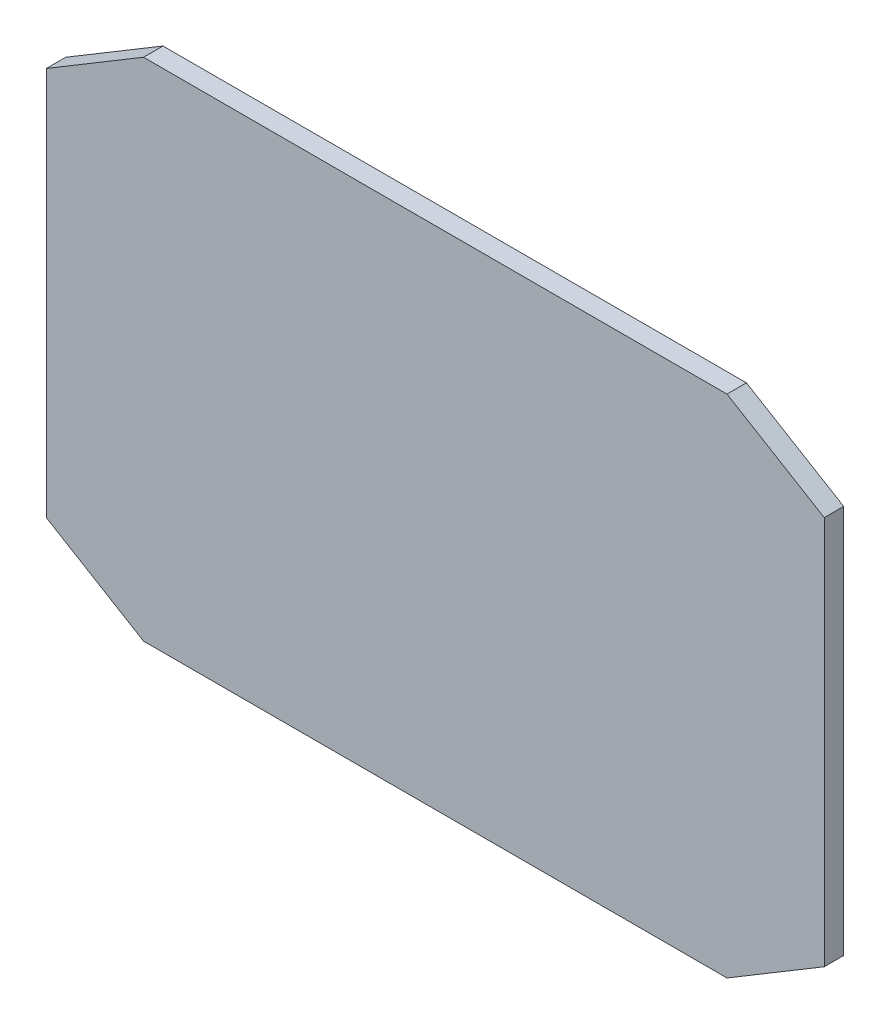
ISO-10303-21;
HEADER;
FILE_DESCRIPTION(('STEP AP214'),'2;1');
FILE_NAME('part.step','',(''),(''),'','','');
FILE_SCHEMA(('AUTOMOTIVE_DESIGN { 1 0 10303 214 1 1 1 1 }'));
ENDSEC;
DATA;
#1=APPLICATION_CONTEXT('core data for automotive mechanical design processes');
#2=APPLICATION_PROTOCOL_DEFINITION('international standard','automotive_design',2000,#1);
#3=PRODUCT_CONTEXT('',#1,'mechanical');
#4=PRODUCT('Part','Part','',(#3));
#5=PRODUCT_RELATED_PRODUCT_CATEGORY('part','',(#4));
#6=PRODUCT_DEFINITION_FORMATION('','',#4);
#7=PRODUCT_DEFINITION_CONTEXT('part definition',#1,'design');
#8=PRODUCT_DEFINITION('design','',#6,#7);
#9=PRODUCT_DEFINITION_SHAPE('','',#8);
#10=(LENGTH_UNIT() NAMED_UNIT(*) SI_UNIT(.MILLI.,.METRE.));
#11=(NAMED_UNIT(*) PLANE_ANGLE_UNIT() SI_UNIT($,.RADIAN.));
#12=(NAMED_UNIT(*) SI_UNIT($,.STERADIAN.) SOLID_ANGLE_UNIT());
#13=UNCERTAINTY_MEASURE_WITH_UNIT(LENGTH_MEASURE(1.E-05),#10,'distance_accuracy_value','');
#14=(GEOMETRIC_REPRESENTATION_CONTEXT(3) GLOBAL_UNCERTAINTY_ASSIGNED_CONTEXT((#13)) GLOBAL_UNIT_ASSIGNED_CONTEXT((#10,
#11,#12)) REPRESENTATION_CONTEXT('',''));
#15=CARTESIAN_POINT('',(0.,0.,0.));
#16=DIRECTION('',(0.,0.,1.));
#17=DIRECTION('',(1.,0.,0.));
#18=AXIS2_PLACEMENT_3D('',#15,#16,#17);
#19=CARTESIAN_POINT('',(0.,-6.66133814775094E-13,10.));
#20=DIRECTION('',(1.,0.,0.));
#21=DIRECTION('',(0.,0.,-1.));
#22=AXIS2_PLACEMENT_3D('',#19,#20,#21);
#23=PLANE('',#22);
#24=DIRECTION('',(0.,-1.,0.));
#25=VECTOR('',#24,1.);
#26=CARTESIAN_POINT('',(0.,0.,0.));
#27=LINE('',#26,#25);
#28=CARTESIAN_POINT('',(0.,230.,-9.99200722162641E-13));
#29=VERTEX_POINT('',#28);
#30=CARTESIAN_POINT('',(0.,30.0000000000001,-6.66133814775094E-13));
#31=VERTEX_POINT('',#30);
#32=EDGE_CURVE('E112',#29,#31,#27,.T.);
#33=ORIENTED_EDGE('',*,*,#32,.T.);
#34=DIRECTION('',(0.,0.,1.));
#35=VECTOR('',#34,1.);
#36=CARTESIAN_POINT('',(0.,30.,9.99999999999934));
#37=LINE('',#36,#35);
#38=CARTESIAN_POINT('',(0.,30.,9.99999999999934));
#39=VERTEX_POINT('',#38);
#40=EDGE_CURVE('E154',#31,#39,#37,.T.);
#41=ORIENTED_EDGE('',*,*,#40,.T.);
#42=DIRECTION('',(0.,-1.,0.));
#43=VECTOR('',#42,1.);
#44=CARTESIAN_POINT('',(0.,-6.66133814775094E-13,10.));
#45=LINE('',#44,#43);
#46=CARTESIAN_POINT('',(0.,230.,9.99999999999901));
#47=VERTEX_POINT('',#46);
#48=EDGE_CURVE('E115',#47,#39,#45,.T.);
#49=ORIENTED_EDGE('',*,*,#48,.F.);
#50=DIRECTION('',(0.,0.,-1.));
#51=VECTOR('',#50,1.);
#52=CARTESIAN_POINT('',(0.,230.,9.99999999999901));
#53=LINE('',#52,#51);
#54=EDGE_CURVE('E101',#47,#29,#53,.T.);
#55=ORIENTED_EDGE('',*,*,#54,.T.);
#56=EDGE_LOOP('',(#33,#41,#49,#55));
#57=FACE_BOUND('',#56,.T.);
#58=ADVANCED_FACE('F32',(#57),#23,.F.);
#59=CARTESIAN_POINT('',(0.,-6.66133814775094E-13,10.));
#60=DIRECTION('',(0.,1.,0.));
#61=DIRECTION('',(0.,0.,1.));
#62=AXIS2_PLACEMENT_3D('',#59,#60,#61);
#63=PLANE('',#62);
#64=DIRECTION('',(1.,0.,0.));
#65=VECTOR('',#64,1.);
#66=CARTESIAN_POINT('',(0.,-6.66133814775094E-13,10.));
#67=LINE('',#66,#65);
#68=CARTESIAN_POINT('',(50.0000000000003,-6.66133814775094E-13,10.));
#69=VERTEX_POINT('',#68);
#70=CARTESIAN_POINT('',(350.,0.,10.));
#71=VERTEX_POINT('',#70);
#72=EDGE_CURVE('E130',#69,#71,#67,.T.);
#73=ORIENTED_EDGE('',*,*,#72,.F.);
#74=DIRECTION('',(0.,0.,-1.));
#75=VECTOR('',#74,1.);
#76=CARTESIAN_POINT('',(50.0000000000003,-6.66133814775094E-13,10.));
#77=LINE('',#76,#75);
#78=CARTESIAN_POINT('',(50.0000000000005,0.,0.));
#79=VERTEX_POINT('',#78);
#80=EDGE_CURVE('E148',#69,#79,#77,.T.);
#81=ORIENTED_EDGE('',*,*,#80,.T.);
#82=DIRECTION('',(1.,0.,0.));
#83=VECTOR('',#82,1.);
#84=CARTESIAN_POINT('',(0.,0.,0.));
#85=LINE('',#84,#83);
#86=CARTESIAN_POINT('',(350.,0.,0.));
#87=VERTEX_POINT('',#86);
#88=EDGE_CURVE('E121',#79,#87,#85,.T.);
#89=ORIENTED_EDGE('',*,*,#88,.T.);
#90=DIRECTION('',(0.,0.,1.));
#91=VECTOR('',#90,1.);
#92=CARTESIAN_POINT('',(350.,0.,10.));
#93=LINE('',#92,#91);
#94=EDGE_CURVE('E145',#87,#71,#93,.T.);
#95=ORIENTED_EDGE('',*,*,#94,.T.);
#96=EDGE_LOOP('',(#73,#81,#89,#95));
#97=FACE_BOUND('',#96,.T.);
#98=ADVANCED_FACE('F177',(#97),#63,.F.);
#99=CARTESIAN_POINT('',(400.,0.,10.));
#100=DIRECTION('',(-1.,0.,0.));
#101=DIRECTION('',(0.,0.,1.));
#102=AXIS2_PLACEMENT_3D('',#99,#100,#101);
#103=PLANE('',#102);
#104=DIRECTION('',(0.,1.,0.));
#105=VECTOR('',#104,1.);
#106=CARTESIAN_POINT('',(400.,0.,0.));
#107=LINE('',#106,#105);
#108=CARTESIAN_POINT('',(400.,30.0000000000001,-6.66133814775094E-13));
#109=VERTEX_POINT('',#108);
#110=CARTESIAN_POINT('',(400.,230.,-9.99200722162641E-13));
#111=VERTEX_POINT('',#110);
#112=EDGE_CURVE('E123',#109,#111,#107,.T.);
#113=ORIENTED_EDGE('',*,*,#112,.T.);
#114=DIRECTION('',(0.,0.,1.));
#115=VECTOR('',#114,1.);
#116=CARTESIAN_POINT('',(400.,230.,9.99999999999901));
#117=LINE('',#116,#115);
#118=CARTESIAN_POINT('',(400.,230.,9.99999999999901));
#119=VERTEX_POINT('',#118);
#120=EDGE_CURVE('E11',#111,#119,#117,.T.);
#121=ORIENTED_EDGE('',*,*,#120,.T.);
#122=DIRECTION('',(0.,1.,0.));
#123=VECTOR('',#122,1.);
#124=CARTESIAN_POINT('',(400.,0.,10.));
#125=LINE('',#124,#123);
#126=CARTESIAN_POINT('',(400.,30.,9.99999999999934));
#127=VERTEX_POINT('',#126);
#128=EDGE_CURVE('E132',#127,#119,#125,.T.);
#129=ORIENTED_EDGE('',*,*,#128,.F.);
#130=DIRECTION('',(0.,0.,-1.));
#131=VECTOR('',#130,1.);
#132=CARTESIAN_POINT('',(400.,30.,9.99999999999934));
#133=LINE('',#132,#131);
#134=EDGE_CURVE('E142',#127,#109,#133,.T.);
#135=ORIENTED_EDGE('',*,*,#134,.T.);
#136=EDGE_LOOP('',(#113,#121,#129,#135));
#137=FACE_BOUND('',#136,.T.);
#138=ADVANCED_FACE('F164',(#137),#103,.F.);
#139=CARTESIAN_POINT('',(0.,260.,10.));
#140=DIRECTION('',(0.,-1.,0.));
#141=DIRECTION('',(0.,0.,-1.));
#142=AXIS2_PLACEMENT_3D('',#139,#140,#141);
#143=PLANE('',#142);
#144=DIRECTION('',(-1.,0.,0.));
#145=VECTOR('',#144,1.);
#146=CARTESIAN_POINT('',(0.,260.,10.));
#147=LINE('',#146,#145);
#148=CARTESIAN_POINT('',(350.,260.,10.));
#149=VERTEX_POINT('',#148);
#150=CARTESIAN_POINT('',(50.0000000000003,260.,10.));
#151=VERTEX_POINT('',#150);
#152=EDGE_CURVE('E116',#149,#151,#147,.T.);
#153=ORIENTED_EDGE('',*,*,#152,.F.);
#154=DIRECTION('',(0.,0.,-1.));
#155=VECTOR('',#154,1.);
#156=CARTESIAN_POINT('',(350.,260.,10.));
#157=LINE('',#156,#155);
#158=CARTESIAN_POINT('',(350.,260.,0.));
#159=VERTEX_POINT('',#158);
#160=EDGE_CURVE('E39',#149,#159,#157,.T.);
#161=ORIENTED_EDGE('',*,*,#160,.T.);
#162=DIRECTION('',(-1.,0.,0.));
#163=VECTOR('',#162,1.);
#164=CARTESIAN_POINT('',(0.,260.,0.));
#165=LINE('',#164,#163);
#166=CARTESIAN_POINT('',(50.0000000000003,260.,0.));
#167=VERTEX_POINT('',#166);
#168=EDGE_CURVE('E127',#159,#167,#165,.T.);
#169=ORIENTED_EDGE('',*,*,#168,.T.);
#170=DIRECTION('',(0.,0.,1.));
#171=VECTOR('',#170,1.);
#172=CARTESIAN_POINT('',(50.0000000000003,260.,10.));
#173=LINE('',#172,#171);
#174=EDGE_CURVE('E103',#167,#151,#173,.T.);
#175=ORIENTED_EDGE('',*,*,#174,.T.);
#176=EDGE_LOOP('',(#153,#161,#169,#175));
#177=FACE_BOUND('',#176,.T.);
#178=ADVANCED_FACE('F161',(#177),#143,.F.);
#179=CARTESIAN_POINT('',(0.,260.,10.));
#180=DIRECTION('',(0.,0.,-1.));
#181=DIRECTION('',(-1.,0.,0.));
#182=AXIS2_PLACEMENT_3D('',#179,#180,#181);
#183=PLANE('',#182);
#184=ORIENTED_EDGE('',*,*,#48,.T.);
#185=DIRECTION('',(-0.857492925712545,0.514495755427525,0.));
#186=VECTOR('',#185,1.);
#187=CARTESIAN_POINT('',(50.0000000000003,-6.66133814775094E-13,10.));
#188=LINE('',#187,#186);
#189=EDGE_CURVE('E157',#39,#69,#188,.F.);
#190=ORIENTED_EDGE('',*,*,#189,.T.);
#191=ORIENTED_EDGE('',*,*,#72,.T.);
#192=DIRECTION('',(-0.857492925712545,-0.514495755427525,0.));
#193=VECTOR('',#192,1.);
#194=CARTESIAN_POINT('',(400.,30.,9.99999999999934));
#195=LINE('',#194,#193);
#196=EDGE_CURVE('E138',#71,#127,#195,.F.);
#197=ORIENTED_EDGE('',*,*,#196,.T.);
#198=ORIENTED_EDGE('',*,*,#128,.T.);
#199=DIRECTION('',(0.857492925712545,-0.514495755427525,0.));
#200=VECTOR('',#199,1.);
#201=CARTESIAN_POINT('',(350.,260.,10.));
#202=LINE('',#201,#200);
#203=EDGE_CURVE('E51',#119,#149,#202,.F.);
#204=ORIENTED_EDGE('',*,*,#203,.T.);
#205=ORIENTED_EDGE('',*,*,#152,.T.);
#206=DIRECTION('',(0.857492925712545,0.514495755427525,0.));
#207=VECTOR('',#206,1.);
#208=CARTESIAN_POINT('',(0.,230.,9.99999999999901));
#209=LINE('',#208,#207);
#210=EDGE_CURVE('E140',#151,#47,#209,.F.);
#211=ORIENTED_EDGE('',*,*,#210,.T.);
#212=EDGE_LOOP('',(#184,#190,#191,#197,#198,#204,#205,#211));
#213=FACE_BOUND('',#212,.T.);
#214=ADVANCED_FACE('F190',(#213),#183,.F.);
#215=CARTESIAN_POINT('',(0.,260.,0.));
#216=DIRECTION('',(0.,0.,-1.));
#217=DIRECTION('',(-1.,0.,0.));
#218=AXIS2_PLACEMENT_3D('',#215,#216,#217);
#219=PLANE('',#218);
#220=ORIENTED_EDGE('',*,*,#88,.F.);
#221=DIRECTION('',(0.857492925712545,-0.514495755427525,0.));
#222=VECTOR('',#221,1.);
#223=CARTESIAN_POINT('',(-101.470588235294,90.8823529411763,-6.66133814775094E-13));
#224=LINE('',#223,#222);
#225=EDGE_CURVE('E120',#79,#31,#224,.F.);
#226=ORIENTED_EDGE('',*,*,#225,.T.);
#227=ORIENTED_EDGE('',*,*,#32,.F.);
#228=DIRECTION('',(-0.857492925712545,-0.514495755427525,0.));
#229=VECTOR('',#228,1.);
#230=CARTESIAN_POINT('',(13.235294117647,237.941176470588,-9.99200722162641E-13));
#231=LINE('',#230,#229);
#232=EDGE_CURVE('E97',#29,#167,#231,.F.);
#233=ORIENTED_EDGE('',*,*,#232,.T.);
#234=ORIENTED_EDGE('',*,*,#168,.F.);
#235=DIRECTION('',(-0.857492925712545,0.514495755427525,0.));
#236=VECTOR('',#235,1.);
#237=CARTESIAN_POINT('',(92.6470588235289,414.411764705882,-6.66133814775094E-13));
#238=LINE('',#237,#236);
#239=EDGE_CURVE('E151',#159,#111,#238,.F.);
#240=ORIENTED_EDGE('',*,*,#239,.T.);
#241=ORIENTED_EDGE('',*,*,#112,.F.);
#242=DIRECTION('',(0.857492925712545,0.514495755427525,0.));
#243=VECTOR('',#242,1.);
#244=CARTESIAN_POINT('',(207.35294117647,-85.5882352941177,-9.99200722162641E-13));
#245=LINE('',#244,#243);
#246=EDGE_CURVE('E107',#109,#87,#245,.F.);
#247=ORIENTED_EDGE('',*,*,#246,.T.);
#248=EDGE_LOOP('',(#220,#226,#227,#233,#234,#240,#241,#247));
#249=FACE_BOUND('',#248,.T.);
#250=ADVANCED_FACE('F119',(#249),#219,.T.);
#251=CARTESIAN_POINT('',(0.,230.,9.99999999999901));
#252=DIRECTION('',(0.514495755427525,-0.857492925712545,0.));
#253=DIRECTION('',(0.857492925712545,0.514495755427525,0.));
#254=AXIS2_PLACEMENT_3D('',#251,#252,#253);
#255=PLANE('',#254);
#256=ORIENTED_EDGE('',*,*,#210,.F.);
#257=ORIENTED_EDGE('',*,*,#174,.F.);
#258=ORIENTED_EDGE('',*,*,#232,.F.);
#259=ORIENTED_EDGE('',*,*,#54,.F.);
#260=EDGE_LOOP('',(#256,#257,#258,#259));
#261=FACE_BOUND('',#260,.T.);
#262=ADVANCED_FACE('F100',(#261),#255,.F.);
#263=CARTESIAN_POINT('',(400.,30.,9.99999999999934));
#264=DIRECTION('',(-0.514495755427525,0.857492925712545,0.));
#265=DIRECTION('',(-0.857492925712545,-0.514495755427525,0.));
#266=AXIS2_PLACEMENT_3D('',#263,#264,#265);
#267=PLANE('',#266);
#268=ORIENTED_EDGE('',*,*,#196,.F.);
#269=ORIENTED_EDGE('',*,*,#94,.F.);
#270=ORIENTED_EDGE('',*,*,#246,.F.);
#271=ORIENTED_EDGE('',*,*,#134,.F.);
#272=EDGE_LOOP('',(#268,#269,#270,#271));
#273=FACE_BOUND('',#272,.T.);
#274=ADVANCED_FACE('F173',(#273),#267,.F.);
#275=CARTESIAN_POINT('',(50.0000000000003,-6.66133814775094E-13,10.));
#276=DIRECTION('',(0.514495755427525,0.857492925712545,0.));
#277=DIRECTION('',(-0.857492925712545,0.514495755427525,0.));
#278=AXIS2_PLACEMENT_3D('',#275,#276,#277);
#279=PLANE('',#278);
#280=ORIENTED_EDGE('',*,*,#189,.F.);
#281=ORIENTED_EDGE('',*,*,#40,.F.);
#282=ORIENTED_EDGE('',*,*,#225,.F.);
#283=ORIENTED_EDGE('',*,*,#80,.F.);
#284=EDGE_LOOP('',(#280,#281,#282,#283));
#285=FACE_BOUND('',#284,.T.);
#286=ADVANCED_FACE('F168',(#285),#279,.F.);
#287=CARTESIAN_POINT('',(350.,260.,10.));
#288=DIRECTION('',(-0.514495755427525,-0.857492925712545,0.));
#289=DIRECTION('',(0.857492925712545,-0.514495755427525,0.));
#290=AXIS2_PLACEMENT_3D('',#287,#288,#289);
#291=PLANE('',#290);
#292=ORIENTED_EDGE('',*,*,#203,.F.);
#293=ORIENTED_EDGE('',*,*,#120,.F.);
#294=ORIENTED_EDGE('',*,*,#239,.F.);
#295=ORIENTED_EDGE('',*,*,#160,.F.);
#296=EDGE_LOOP('',(#292,#293,#294,#295));
#297=FACE_BOUND('',#296,.T.);
#298=ADVANCED_FACE('F166',(#297),#291,.F.);
#299=CLOSED_SHELL('',(#58,#98,#138,#178,#214,#250,#262,#274,#286,#298));
#300=MANIFOLD_SOLID_BREP('B2',#299);
#301=ADVANCED_BREP_SHAPE_REPRESENTATION('',(#18,#300),#14);
#302=SHAPE_DEFINITION_REPRESENTATION(#9,#301);
ENDSEC;
END-ISO-10303-21;
